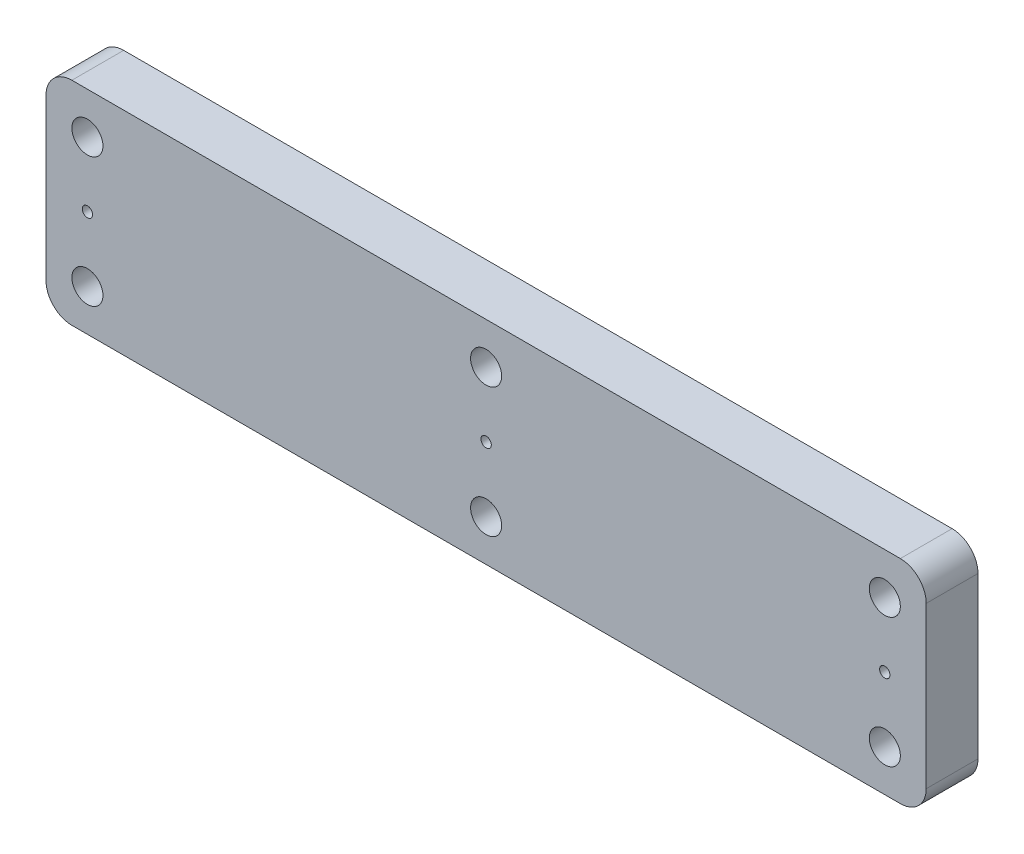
ISO-10303-21;
HEADER;
FILE_DESCRIPTION(('STEP AP214'),'2;1');
FILE_NAME('part.step','',(''),(''),'','','');
FILE_SCHEMA(('AUTOMOTIVE_DESIGN { 1 0 10303 214 1 1 1 1 }'));
ENDSEC;
DATA;
#1=APPLICATION_CONTEXT('core data for automotive mechanical design processes');
#2=APPLICATION_PROTOCOL_DEFINITION('international standard','automotive_design',2000,#1);
#3=PRODUCT_CONTEXT('',#1,'mechanical');
#4=PRODUCT('Part','Part','',(#3));
#5=PRODUCT_RELATED_PRODUCT_CATEGORY('part','',(#4));
#6=PRODUCT_DEFINITION_FORMATION('','',#4);
#7=PRODUCT_DEFINITION_CONTEXT('part definition',#1,'design');
#8=PRODUCT_DEFINITION('design','',#6,#7);
#9=PRODUCT_DEFINITION_SHAPE('','',#8);
#10=(LENGTH_UNIT() NAMED_UNIT(*) SI_UNIT(.MILLI.,.METRE.));
#11=(NAMED_UNIT(*) PLANE_ANGLE_UNIT() SI_UNIT($,.RADIAN.));
#12=(NAMED_UNIT(*) SI_UNIT($,.STERADIAN.) SOLID_ANGLE_UNIT());
#13=UNCERTAINTY_MEASURE_WITH_UNIT(LENGTH_MEASURE(1.E-05),#10,'distance_accuracy_value','');
#14=(GEOMETRIC_REPRESENTATION_CONTEXT(3) GLOBAL_UNCERTAINTY_ASSIGNED_CONTEXT((#13)) GLOBAL_UNIT_ASSIGNED_CONTEXT((#10,
#11,#12)) REPRESENTATION_CONTEXT('',''));
#15=CARTESIAN_POINT('',(0.,0.,0.));
#16=DIRECTION('',(0.,0.,1.));
#17=DIRECTION('',(1.,0.,0.));
#18=AXIS2_PLACEMENT_3D('',#15,#16,#17);
#19=CARTESIAN_POINT('',(5.,36.,10.));
#20=DIRECTION('',(0.,0.,-1.));
#21=DIRECTION('',(-1.,0.,0.));
#22=AXIS2_PLACEMENT_3D('',#19,#20,#21);
#23=PLANE('',#22);
#24=CARTESIAN_POINT('',(162.,20.5,10.));
#25=DIRECTION('',(0.,0.,1.));
#26=DIRECTION('',(1.,0.,0.));
#27=AXIS2_PLACEMENT_3D('',#24,#25,#26);
#28=CIRCLE('',#27,0.999999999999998);
#29=CARTESIAN_POINT('',(163.,20.5,10.));
#30=VERTEX_POINT('',#29);
#31=EDGE_CURVE('E250',#30,#30,#28,.T.);
#32=ORIENTED_EDGE('',*,*,#31,.F.);
#33=EDGE_LOOP('',(#32));
#34=FACE_BOUND('',#33,.T.);
#35=CARTESIAN_POINT('',(85.,20.5,10.));
#36=DIRECTION('',(0.,0.,1.));
#37=DIRECTION('',(1.,0.,0.));
#38=AXIS2_PLACEMENT_3D('',#35,#36,#37);
#39=CIRCLE('',#38,0.999999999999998);
#40=CARTESIAN_POINT('',(86.,20.5,10.));
#41=VERTEX_POINT('',#40);
#42=EDGE_CURVE('E249',#41,#41,#39,.T.);
#43=ORIENTED_EDGE('',*,*,#42,.F.);
#44=EDGE_LOOP('',(#43));
#45=FACE_BOUND('',#44,.T.);
#46=CARTESIAN_POINT('',(8.,20.5,10.));
#47=DIRECTION('',(0.,0.,1.));
#48=DIRECTION('',(1.,0.,0.));
#49=AXIS2_PLACEMENT_3D('',#46,#47,#48);
#50=CIRCLE('',#49,1.);
#51=CARTESIAN_POINT('',(9.,20.5,10.));
#52=VERTEX_POINT('',#51);
#53=EDGE_CURVE('E260',#52,#52,#50,.T.);
#54=ORIENTED_EDGE('',*,*,#53,.F.);
#55=EDGE_LOOP('',(#54));
#56=FACE_BOUND('',#55,.T.);
#57=CARTESIAN_POINT('',(85.,8.,10.));
#58=DIRECTION('',(0.,0.,1.));
#59=DIRECTION('',(1.,0.,0.));
#60=AXIS2_PLACEMENT_3D('',#57,#58,#59);
#61=CIRCLE('',#60,3.00000000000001);
#62=CARTESIAN_POINT('',(88.,8.,10.));
#63=VERTEX_POINT('',#62);
#64=EDGE_CURVE('E275',#63,#63,#61,.T.);
#65=ORIENTED_EDGE('',*,*,#64,.F.);
#66=EDGE_LOOP('',(#65));
#67=FACE_BOUND('',#66,.T.);
#68=CARTESIAN_POINT('',(162.,8.,10.));
#69=DIRECTION('',(0.,0.,1.));
#70=DIRECTION('',(1.,0.,0.));
#71=AXIS2_PLACEMENT_3D('',#68,#69,#70);
#72=CIRCLE('',#71,2.99999999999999);
#73=CARTESIAN_POINT('',(165.,8.,10.));
#74=VERTEX_POINT('',#73);
#75=EDGE_CURVE('E287',#74,#74,#72,.T.);
#76=ORIENTED_EDGE('',*,*,#75,.F.);
#77=EDGE_LOOP('',(#76));
#78=FACE_BOUND('',#77,.T.);
#79=CARTESIAN_POINT('',(8.,33.,10.));
#80=DIRECTION('',(0.,0.,1.));
#81=DIRECTION('',(1.,0.,0.));
#82=AXIS2_PLACEMENT_3D('',#79,#80,#81);
#83=CIRCLE('',#82,3.);
#84=CARTESIAN_POINT('',(11.,33.,10.));
#85=VERTEX_POINT('',#84);
#86=EDGE_CURVE('E110',#85,#85,#83,.T.);
#87=ORIENTED_EDGE('',*,*,#86,.F.);
#88=EDGE_LOOP('',(#87));
#89=FACE_BOUND('',#88,.T.);
#90=CARTESIAN_POINT('',(5.,36.,10.));
#91=DIRECTION('',(0.,0.,1.));
#92=DIRECTION('',(-1.,0.,0.));
#93=AXIS2_PLACEMENT_3D('',#90,#91,#92);
#94=CIRCLE('',#93,5.);
#95=CARTESIAN_POINT('',(5.00000000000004,41.,10.));
#96=VERTEX_POINT('',#95);
#97=CARTESIAN_POINT('',(0.,36.,10.));
#98=VERTEX_POINT('',#97);
#99=EDGE_CURVE('E128',#96,#98,#94,.T.);
#100=ORIENTED_EDGE('',*,*,#99,.T.);
#101=DIRECTION('',(0.,-1.,0.));
#102=VECTOR('',#101,1.);
#103=CARTESIAN_POINT('',(0.,5.00000000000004,10.));
#104=LINE('',#103,#102);
#105=CARTESIAN_POINT('',(0.,5.00000000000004,10.));
#106=VERTEX_POINT('',#105);
#107=EDGE_CURVE('E105',#98,#106,#104,.T.);
#108=ORIENTED_EDGE('',*,*,#107,.T.);
#109=CARTESIAN_POINT('',(5.,5.,10.));
#110=DIRECTION('',(0.,0.,1.));
#111=DIRECTION('',(-1.,0.,0.));
#112=AXIS2_PLACEMENT_3D('',#109,#110,#111);
#113=CIRCLE('',#112,5.);
#114=CARTESIAN_POINT('',(5.00000000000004,0.,10.));
#115=VERTEX_POINT('',#114);
#116=EDGE_CURVE('E131',#106,#115,#113,.T.);
#117=ORIENTED_EDGE('',*,*,#116,.T.);
#118=DIRECTION('',(1.,0.,0.));
#119=VECTOR('',#118,1.);
#120=CARTESIAN_POINT('',(5.00000000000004,0.,10.));
#121=LINE('',#120,#119);
#122=CARTESIAN_POINT('',(165.,0.,10.));
#123=VERTEX_POINT('',#122);
#124=EDGE_CURVE('E133',#115,#123,#121,.T.);
#125=ORIENTED_EDGE('',*,*,#124,.T.);
#126=CARTESIAN_POINT('',(165.,5.,10.));
#127=DIRECTION('',(0.,0.,1.));
#128=DIRECTION('',(1.,0.,0.));
#129=AXIS2_PLACEMENT_3D('',#126,#127,#128);
#130=CIRCLE('',#129,5.);
#131=CARTESIAN_POINT('',(170.,5.00000000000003,10.));
#132=VERTEX_POINT('',#131);
#133=EDGE_CURVE('E135',#123,#132,#130,.T.);
#134=ORIENTED_EDGE('',*,*,#133,.T.);
#135=DIRECTION('',(0.,1.,0.));
#136=VECTOR('',#135,1.);
#137=CARTESIAN_POINT('',(170.,5.00000000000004,10.));
#138=LINE('',#137,#136);
#139=CARTESIAN_POINT('',(170.,36.,10.));
#140=VERTEX_POINT('',#139);
#141=EDGE_CURVE('E137',#132,#140,#138,.T.);
#142=ORIENTED_EDGE('',*,*,#141,.T.);
#143=CARTESIAN_POINT('',(165.,36.,10.));
#144=DIRECTION('',(0.,0.,1.));
#145=DIRECTION('',(-1.,0.,0.));
#146=AXIS2_PLACEMENT_3D('',#143,#144,#145);
#147=CIRCLE('',#146,5.);
#148=CARTESIAN_POINT('',(165.,41.,10.));
#149=VERTEX_POINT('',#148);
#150=EDGE_CURVE('E46',#140,#149,#147,.T.);
#151=ORIENTED_EDGE('',*,*,#150,.T.);
#152=DIRECTION('',(-1.,0.,0.));
#153=VECTOR('',#152,1.);
#154=CARTESIAN_POINT('',(5.00000000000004,41.,10.));
#155=LINE('',#154,#153);
#156=EDGE_CURVE('E41',#149,#96,#155,.T.);
#157=ORIENTED_EDGE('',*,*,#156,.T.);
#158=EDGE_LOOP('',(#100,#108,#117,#125,#134,#142,#151,#157));
#159=FACE_BOUND('',#158,.T.);
#160=CARTESIAN_POINT('',(162.,33.,10.));
#161=DIRECTION('',(0.,0.,1.));
#162=DIRECTION('',(1.,0.,0.));
#163=AXIS2_PLACEMENT_3D('',#160,#161,#162);
#164=CIRCLE('',#163,2.99999999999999);
#165=CARTESIAN_POINT('',(165.,33.,10.));
#166=VERTEX_POINT('',#165);
#167=EDGE_CURVE('E293',#166,#166,#164,.T.);
#168=ORIENTED_EDGE('',*,*,#167,.F.);
#169=EDGE_LOOP('',(#168));
#170=FACE_BOUND('',#169,.T.);
#171=CARTESIAN_POINT('',(85.,33.,10.));
#172=DIRECTION('',(0.,0.,1.));
#173=DIRECTION('',(1.,0.,0.));
#174=AXIS2_PLACEMENT_3D('',#171,#172,#173);
#175=CIRCLE('',#174,3.00000000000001);
#176=CARTESIAN_POINT('',(88.,33.,10.));
#177=VERTEX_POINT('',#176);
#178=EDGE_CURVE('E281',#177,#177,#175,.T.);
#179=ORIENTED_EDGE('',*,*,#178,.F.);
#180=EDGE_LOOP('',(#179));
#181=FACE_BOUND('',#180,.T.);
#182=CARTESIAN_POINT('',(8.00000000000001,8.,10.));
#183=DIRECTION('',(0.,0.,1.));
#184=DIRECTION('',(1.,0.,0.));
#185=AXIS2_PLACEMENT_3D('',#182,#183,#184);
#186=CIRCLE('',#185,3.);
#187=CARTESIAN_POINT('',(11.,8.,10.));
#188=VERTEX_POINT('',#187);
#189=EDGE_CURVE('E269',#188,#188,#186,.T.);
#190=ORIENTED_EDGE('',*,*,#189,.F.);
#191=EDGE_LOOP('',(#190));
#192=FACE_BOUND('',#191,.T.);
#193=ADVANCED_FACE('F26',(#34,#45,#56,#67,#78,#89,#159,#170,#181,#192),#23,.F.);
#194=CARTESIAN_POINT('',(5.,36.,0.));
#195=DIRECTION('',(0.,0.,-1.));
#196=DIRECTION('',(-1.,0.,0.));
#197=AXIS2_PLACEMENT_3D('',#194,#195,#196);
#198=PLANE('',#197);
#199=CARTESIAN_POINT('',(85.,8.,0.));
#200=DIRECTION('',(0.,0.,1.));
#201=DIRECTION('',(1.,0.,0.));
#202=AXIS2_PLACEMENT_3D('',#199,#200,#201);
#203=CIRCLE('',#202,3.00000000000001);
#204=CARTESIAN_POINT('',(88.,8.,0.));
#205=VERTEX_POINT('',#204);
#206=EDGE_CURVE('E272',#205,#205,#203,.T.);
#207=ORIENTED_EDGE('',*,*,#206,.T.);
#208=EDGE_LOOP('',(#207));
#209=FACE_BOUND('',#208,.T.);
#210=CARTESIAN_POINT('',(162.,8.,0.));
#211=DIRECTION('',(0.,0.,1.));
#212=DIRECTION('',(1.,0.,0.));
#213=AXIS2_PLACEMENT_3D('',#210,#211,#212);
#214=CIRCLE('',#213,2.99999999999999);
#215=CARTESIAN_POINT('',(165.,8.,0.));
#216=VERTEX_POINT('',#215);
#217=EDGE_CURVE('E284',#216,#216,#214,.T.);
#218=ORIENTED_EDGE('',*,*,#217,.T.);
#219=EDGE_LOOP('',(#218));
#220=FACE_BOUND('',#219,.T.);
#221=CARTESIAN_POINT('',(8.,33.,0.));
#222=DIRECTION('',(0.,0.,1.));
#223=DIRECTION('',(1.,0.,0.));
#224=AXIS2_PLACEMENT_3D('',#221,#222,#223);
#225=CIRCLE('',#224,3.);
#226=CARTESIAN_POINT('',(11.,33.,0.));
#227=VERTEX_POINT('',#226);
#228=EDGE_CURVE('E113',#227,#227,#225,.T.);
#229=ORIENTED_EDGE('',*,*,#228,.T.);
#230=EDGE_LOOP('',(#229));
#231=FACE_BOUND('',#230,.T.);
#232=CARTESIAN_POINT('',(5.,36.,0.));
#233=DIRECTION('',(0.,0.,1.));
#234=DIRECTION('',(-1.,0.,0.));
#235=AXIS2_PLACEMENT_3D('',#232,#233,#234);
#236=CIRCLE('',#235,5.);
#237=CARTESIAN_POINT('',(5.00000000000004,41.,0.));
#238=VERTEX_POINT('',#237);
#239=CARTESIAN_POINT('',(0.,36.,0.));
#240=VERTEX_POINT('',#239);
#241=EDGE_CURVE('E96',#238,#240,#236,.T.);
#242=ORIENTED_EDGE('',*,*,#241,.F.);
#243=DIRECTION('',(-1.,0.,0.));
#244=VECTOR('',#243,1.);
#245=CARTESIAN_POINT('',(5.00000000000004,41.,0.));
#246=LINE('',#245,#244);
#247=CARTESIAN_POINT('',(165.,41.,0.));
#248=VERTEX_POINT('',#247);
#249=EDGE_CURVE('E126',#248,#238,#246,.T.);
#250=ORIENTED_EDGE('',*,*,#249,.F.);
#251=CARTESIAN_POINT('',(165.,36.,0.));
#252=DIRECTION('',(0.,0.,1.));
#253=DIRECTION('',(-1.,0.,0.));
#254=AXIS2_PLACEMENT_3D('',#251,#252,#253);
#255=CIRCLE('',#254,5.);
#256=CARTESIAN_POINT('',(170.,36.,0.));
#257=VERTEX_POINT('',#256);
#258=EDGE_CURVE('E124',#257,#248,#255,.T.);
#259=ORIENTED_EDGE('',*,*,#258,.F.);
#260=DIRECTION('',(0.,1.,0.));
#261=VECTOR('',#260,1.);
#262=CARTESIAN_POINT('',(170.,5.00000000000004,0.));
#263=LINE('',#262,#261);
#264=CARTESIAN_POINT('',(170.,5.00000000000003,0.));
#265=VERTEX_POINT('',#264);
#266=EDGE_CURVE('E122',#265,#257,#263,.T.);
#267=ORIENTED_EDGE('',*,*,#266,.F.);
#268=CARTESIAN_POINT('',(165.,5.,0.));
#269=DIRECTION('',(0.,0.,1.));
#270=DIRECTION('',(1.,0.,0.));
#271=AXIS2_PLACEMENT_3D('',#268,#269,#270);
#272=CIRCLE('',#271,5.);
#273=CARTESIAN_POINT('',(165.,0.,0.));
#274=VERTEX_POINT('',#273);
#275=EDGE_CURVE('E120',#274,#265,#272,.T.);
#276=ORIENTED_EDGE('',*,*,#275,.F.);
#277=DIRECTION('',(1.,0.,0.));
#278=VECTOR('',#277,1.);
#279=CARTESIAN_POINT('',(5.00000000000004,0.,0.));
#280=LINE('',#279,#278);
#281=CARTESIAN_POINT('',(5.00000000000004,0.,0.));
#282=VERTEX_POINT('',#281);
#283=EDGE_CURVE('E118',#282,#274,#280,.T.);
#284=ORIENTED_EDGE('',*,*,#283,.F.);
#285=CARTESIAN_POINT('',(5.,5.,0.));
#286=DIRECTION('',(0.,0.,1.));
#287=DIRECTION('',(-1.,0.,0.));
#288=AXIS2_PLACEMENT_3D('',#285,#286,#287);
#289=CIRCLE('',#288,5.);
#290=CARTESIAN_POINT('',(0.,5.00000000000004,0.));
#291=VERTEX_POINT('',#290);
#292=EDGE_CURVE('E98',#291,#282,#289,.T.);
#293=ORIENTED_EDGE('',*,*,#292,.F.);
#294=DIRECTION('',(0.,-1.,0.));
#295=VECTOR('',#294,1.);
#296=CARTESIAN_POINT('',(0.,5.00000000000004,0.));
#297=LINE('',#296,#295);
#298=EDGE_CURVE('E91',#240,#291,#297,.T.);
#299=ORIENTED_EDGE('',*,*,#298,.F.);
#300=EDGE_LOOP('',(#242,#250,#259,#267,#276,#284,#293,#299));
#301=FACE_BOUND('',#300,.T.);
#302=CARTESIAN_POINT('',(162.,33.,0.));
#303=DIRECTION('',(0.,0.,1.));
#304=DIRECTION('',(1.,0.,0.));
#305=AXIS2_PLACEMENT_3D('',#302,#303,#304);
#306=CIRCLE('',#305,2.99999999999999);
#307=CARTESIAN_POINT('',(165.,33.,0.));
#308=VERTEX_POINT('',#307);
#309=EDGE_CURVE('E290',#308,#308,#306,.T.);
#310=ORIENTED_EDGE('',*,*,#309,.T.);
#311=EDGE_LOOP('',(#310));
#312=FACE_BOUND('',#311,.T.);
#313=CARTESIAN_POINT('',(85.,33.,0.));
#314=DIRECTION('',(0.,0.,1.));
#315=DIRECTION('',(1.,0.,0.));
#316=AXIS2_PLACEMENT_3D('',#313,#314,#315);
#317=CIRCLE('',#316,3.00000000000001);
#318=CARTESIAN_POINT('',(88.,33.,0.));
#319=VERTEX_POINT('',#318);
#320=EDGE_CURVE('E278',#319,#319,#317,.T.);
#321=ORIENTED_EDGE('',*,*,#320,.T.);
#322=EDGE_LOOP('',(#321));
#323=FACE_BOUND('',#322,.T.);
#324=CARTESIAN_POINT('',(8.00000000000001,8.,0.));
#325=DIRECTION('',(0.,0.,1.));
#326=DIRECTION('',(1.,0.,0.));
#327=AXIS2_PLACEMENT_3D('',#324,#325,#326);
#328=CIRCLE('',#327,3.);
#329=CARTESIAN_POINT('',(11.,8.,0.));
#330=VERTEX_POINT('',#329);
#331=EDGE_CURVE('E266',#330,#330,#328,.T.);
#332=ORIENTED_EDGE('',*,*,#331,.T.);
#333=EDGE_LOOP('',(#332));
#334=FACE_BOUND('',#333,.T.);
#335=ADVANCED_FACE('F92',(#209,#220,#231,#301,#312,#323,#334),#198,.T.);
#336=CARTESIAN_POINT('',(5.,36.,10.));
#337=DIRECTION('',(0.,0.,-1.));
#338=DIRECTION('',(-1.,0.,0.));
#339=AXIS2_PLACEMENT_3D('',#336,#337,#338);
#340=CYLINDRICAL_SURFACE('',#339,5.);
#341=ORIENTED_EDGE('',*,*,#241,.T.);
#342=DIRECTION('',(0.,0.,-1.));
#343=VECTOR('',#342,1.);
#344=CARTESIAN_POINT('',(0.,36.,10.));
#345=LINE('',#344,#343);
#346=EDGE_CURVE('E11',#98,#240,#345,.T.);
#347=ORIENTED_EDGE('',*,*,#346,.F.);
#348=ORIENTED_EDGE('',*,*,#99,.F.);
#349=DIRECTION('',(0.,0.,-1.));
#350=VECTOR('',#349,1.);
#351=CARTESIAN_POINT('',(5.00000000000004,41.,10.));
#352=LINE('',#351,#350);
#353=EDGE_CURVE('E109',#96,#238,#352,.T.);
#354=ORIENTED_EDGE('',*,*,#353,.T.);
#355=EDGE_LOOP('',(#341,#347,#348,#354));
#356=FACE_BOUND('',#355,.T.);
#357=ADVANCED_FACE('F28',(#356),#340,.T.);
#358=CARTESIAN_POINT('',(0.,5.00000000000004,10.));
#359=DIRECTION('',(1.,0.,0.));
#360=DIRECTION('',(0.,0.,-1.));
#361=AXIS2_PLACEMENT_3D('',#358,#359,#360);
#362=PLANE('',#361);
#363=ORIENTED_EDGE('',*,*,#298,.T.);
#364=DIRECTION('',(0.,0.,-1.));
#365=VECTOR('',#364,1.);
#366=CARTESIAN_POINT('',(0.,5.00000000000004,10.));
#367=LINE('',#366,#365);
#368=EDGE_CURVE('E34',#106,#291,#367,.T.);
#369=ORIENTED_EDGE('',*,*,#368,.F.);
#370=ORIENTED_EDGE('',*,*,#107,.F.);
#371=ORIENTED_EDGE('',*,*,#346,.T.);
#372=EDGE_LOOP('',(#363,#369,#370,#371));
#373=FACE_BOUND('',#372,.T.);
#374=ADVANCED_FACE('F104',(#373),#362,.F.);
#375=CARTESIAN_POINT('',(5.,5.,10.));
#376=DIRECTION('',(0.,0.,-1.));
#377=DIRECTION('',(-1.,0.,0.));
#378=AXIS2_PLACEMENT_3D('',#375,#376,#377);
#379=CYLINDRICAL_SURFACE('',#378,5.);
#380=ORIENTED_EDGE('',*,*,#292,.T.);
#381=DIRECTION('',(0.,0.,-1.));
#382=VECTOR('',#381,1.);
#383=CARTESIAN_POINT('',(5.00000000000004,0.,10.));
#384=LINE('',#383,#382);
#385=EDGE_CURVE('E154',#115,#282,#384,.T.);
#386=ORIENTED_EDGE('',*,*,#385,.F.);
#387=ORIENTED_EDGE('',*,*,#116,.F.);
#388=ORIENTED_EDGE('',*,*,#368,.T.);
#389=EDGE_LOOP('',(#380,#386,#387,#388));
#390=FACE_BOUND('',#389,.T.);
#391=ADVANCED_FACE('F158',(#390),#379,.T.);
#392=CARTESIAN_POINT('',(5.00000000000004,0.,10.));
#393=DIRECTION('',(0.,1.,0.));
#394=DIRECTION('',(0.,0.,1.));
#395=AXIS2_PLACEMENT_3D('',#392,#393,#394);
#396=PLANE('',#395);
#397=ORIENTED_EDGE('',*,*,#283,.T.);
#398=DIRECTION('',(0.,0.,-1.));
#399=VECTOR('',#398,1.);
#400=CARTESIAN_POINT('',(165.,0.,10.));
#401=LINE('',#400,#399);
#402=EDGE_CURVE('E151',#123,#274,#401,.T.);
#403=ORIENTED_EDGE('',*,*,#402,.F.);
#404=ORIENTED_EDGE('',*,*,#124,.F.);
#405=ORIENTED_EDGE('',*,*,#385,.T.);
#406=EDGE_LOOP('',(#397,#403,#404,#405));
#407=FACE_BOUND('',#406,.T.);
#408=ADVANCED_FACE('F166',(#407),#396,.F.);
#409=CARTESIAN_POINT('',(165.,5.,10.));
#410=DIRECTION('',(0.,0.,-1.));
#411=DIRECTION('',(-1.,0.,0.));
#412=AXIS2_PLACEMENT_3D('',#409,#410,#411);
#413=CYLINDRICAL_SURFACE('',#412,5.);
#414=ORIENTED_EDGE('',*,*,#275,.T.);
#415=DIRECTION('',(0.,0.,-1.));
#416=VECTOR('',#415,1.);
#417=CARTESIAN_POINT('',(170.,5.00000000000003,10.));
#418=LINE('',#417,#416);
#419=EDGE_CURVE('E148',#132,#265,#418,.T.);
#420=ORIENTED_EDGE('',*,*,#419,.F.);
#421=ORIENTED_EDGE('',*,*,#133,.F.);
#422=ORIENTED_EDGE('',*,*,#402,.T.);
#423=EDGE_LOOP('',(#414,#420,#421,#422));
#424=FACE_BOUND('',#423,.T.);
#425=ADVANCED_FACE('F169',(#424),#413,.T.);
#426=CARTESIAN_POINT('',(170.,5.00000000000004,10.));
#427=DIRECTION('',(-1.,0.,0.));
#428=DIRECTION('',(0.,0.,1.));
#429=AXIS2_PLACEMENT_3D('',#426,#427,#428);
#430=PLANE('',#429);
#431=ORIENTED_EDGE('',*,*,#266,.T.);
#432=DIRECTION('',(0.,0.,-1.));
#433=VECTOR('',#432,1.);
#434=CARTESIAN_POINT('',(170.,36.,10.));
#435=LINE('',#434,#433);
#436=EDGE_CURVE('E145',#140,#257,#435,.T.);
#437=ORIENTED_EDGE('',*,*,#436,.F.);
#438=ORIENTED_EDGE('',*,*,#141,.F.);
#439=ORIENTED_EDGE('',*,*,#419,.T.);
#440=EDGE_LOOP('',(#431,#437,#438,#439));
#441=FACE_BOUND('',#440,.T.);
#442=ADVANCED_FACE('F174',(#441),#430,.F.);
#443=CARTESIAN_POINT('',(165.,36.,10.));
#444=DIRECTION('',(0.,0.,-1.));
#445=DIRECTION('',(-1.,0.,0.));
#446=AXIS2_PLACEMENT_3D('',#443,#444,#445);
#447=CYLINDRICAL_SURFACE('',#446,5.);
#448=ORIENTED_EDGE('',*,*,#258,.T.);
#449=DIRECTION('',(0.,0.,-1.));
#450=VECTOR('',#449,1.);
#451=CARTESIAN_POINT('',(165.,41.,10.));
#452=LINE('',#451,#450);
#453=EDGE_CURVE('E142',#149,#248,#452,.T.);
#454=ORIENTED_EDGE('',*,*,#453,.F.);
#455=ORIENTED_EDGE('',*,*,#150,.F.);
#456=ORIENTED_EDGE('',*,*,#436,.T.);
#457=EDGE_LOOP('',(#448,#454,#455,#456));
#458=FACE_BOUND('',#457,.T.);
#459=ADVANCED_FACE('F177',(#458),#447,.T.);
#460=CARTESIAN_POINT('',(5.00000000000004,41.,10.));
#461=DIRECTION('',(0.,-1.,0.));
#462=DIRECTION('',(0.,0.,-1.));
#463=AXIS2_PLACEMENT_3D('',#460,#461,#462);
#464=PLANE('',#463);
#465=ORIENTED_EDGE('',*,*,#249,.T.);
#466=ORIENTED_EDGE('',*,*,#353,.F.);
#467=ORIENTED_EDGE('',*,*,#156,.F.);
#468=ORIENTED_EDGE('',*,*,#453,.T.);
#469=EDGE_LOOP('',(#465,#466,#467,#468));
#470=FACE_BOUND('',#469,.T.);
#471=ADVANCED_FACE('F179',(#470),#464,.F.);
#472=CARTESIAN_POINT('',(8.,33.,10.));
#473=DIRECTION('',(0.,0.,-1.));
#474=DIRECTION('',(-1.,0.,0.));
#475=AXIS2_PLACEMENT_3D('',#472,#473,#474);
#476=CYLINDRICAL_SURFACE('',#475,3.);
#477=ORIENTED_EDGE('',*,*,#86,.T.);
#478=EDGE_LOOP('',(#477));
#479=FACE_BOUND('',#478,.T.);
#480=ORIENTED_EDGE('',*,*,#228,.F.);
#481=EDGE_LOOP('',(#480));
#482=FACE_BOUND('',#481,.T.);
#483=ADVANCED_FACE('F181',(#479,#482),#476,.F.);
#484=CARTESIAN_POINT('',(162.,33.,10.));
#485=DIRECTION('',(0.,0.,-1.));
#486=DIRECTION('',(-1.,0.,0.));
#487=AXIS2_PLACEMENT_3D('',#484,#485,#486);
#488=CYLINDRICAL_SURFACE('',#487,2.99999999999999);
#489=ORIENTED_EDGE('',*,*,#167,.T.);
#490=EDGE_LOOP('',(#489));
#491=FACE_BOUND('',#490,.T.);
#492=ORIENTED_EDGE('',*,*,#309,.F.);
#493=EDGE_LOOP('',(#492));
#494=FACE_BOUND('',#493,.T.);
#495=ADVANCED_FACE('F187',(#491,#494),#488,.F.);
#496=CARTESIAN_POINT('',(162.,8.,10.));
#497=DIRECTION('',(0.,0.,-1.));
#498=DIRECTION('',(-1.,0.,0.));
#499=AXIS2_PLACEMENT_3D('',#496,#497,#498);
#500=CYLINDRICAL_SURFACE('',#499,2.99999999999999);
#501=ORIENTED_EDGE('',*,*,#75,.T.);
#502=EDGE_LOOP('',(#501));
#503=FACE_BOUND('',#502,.T.);
#504=ORIENTED_EDGE('',*,*,#217,.F.);
#505=EDGE_LOOP('',(#504));
#506=FACE_BOUND('',#505,.T.);
#507=ADVANCED_FACE('F206',(#503,#506),#500,.F.);
#508=CARTESIAN_POINT('',(85.,33.,10.));
#509=DIRECTION('',(0.,0.,-1.));
#510=DIRECTION('',(-1.,0.,0.));
#511=AXIS2_PLACEMENT_3D('',#508,#509,#510);
#512=CYLINDRICAL_SURFACE('',#511,3.00000000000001);
#513=ORIENTED_EDGE('',*,*,#178,.T.);
#514=EDGE_LOOP('',(#513));
#515=FACE_BOUND('',#514,.T.);
#516=ORIENTED_EDGE('',*,*,#320,.F.);
#517=EDGE_LOOP('',(#516));
#518=FACE_BOUND('',#517,.T.);
#519=ADVANCED_FACE('F210',(#515,#518),#512,.F.);
#520=CARTESIAN_POINT('',(85.,8.,10.));
#521=DIRECTION('',(0.,0.,-1.));
#522=DIRECTION('',(-1.,0.,0.));
#523=AXIS2_PLACEMENT_3D('',#520,#521,#522);
#524=CYLINDRICAL_SURFACE('',#523,3.00000000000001);
#525=ORIENTED_EDGE('',*,*,#64,.T.);
#526=EDGE_LOOP('',(#525));
#527=FACE_BOUND('',#526,.T.);
#528=ORIENTED_EDGE('',*,*,#206,.F.);
#529=EDGE_LOOP('',(#528));
#530=FACE_BOUND('',#529,.T.);
#531=ADVANCED_FACE('F214',(#527,#530),#524,.F.);
#532=CARTESIAN_POINT('',(8.00000000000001,8.,10.));
#533=DIRECTION('',(0.,0.,-1.));
#534=DIRECTION('',(-1.,0.,0.));
#535=AXIS2_PLACEMENT_3D('',#532,#533,#534);
#536=CYLINDRICAL_SURFACE('',#535,3.);
#537=ORIENTED_EDGE('',*,*,#189,.T.);
#538=EDGE_LOOP('',(#537));
#539=FACE_BOUND('',#538,.T.);
#540=ORIENTED_EDGE('',*,*,#331,.F.);
#541=EDGE_LOOP('',(#540));
#542=FACE_BOUND('',#541,.T.);
#543=ADVANCED_FACE('F218',(#539,#542),#536,.F.);
#544=CARTESIAN_POINT('',(8.,20.5,8.));
#545=DIRECTION('',(0.,0.,1.));
#546=DIRECTION('',(1.,0.,0.));
#547=AXIS2_PLACEMENT_3D('',#544,#545,#546);
#548=CYLINDRICAL_SURFACE('',#547,1.);
#549=CARTESIAN_POINT('',(8.,20.5,8.));
#550=DIRECTION('',(0.,0.,1.));
#551=DIRECTION('',(1.,0.,0.));
#552=AXIS2_PLACEMENT_3D('',#549,#550,#551);
#553=CIRCLE('',#552,1.);
#554=CARTESIAN_POINT('',(9.,20.5,8.));
#555=VERTEX_POINT('',#554);
#556=EDGE_CURVE('E263',#555,#555,#553,.T.);
#557=ORIENTED_EDGE('',*,*,#556,.F.);
#558=EDGE_LOOP('',(#557));
#559=FACE_BOUND('',#558,.T.);
#560=ORIENTED_EDGE('',*,*,#53,.T.);
#561=EDGE_LOOP('',(#560));
#562=FACE_BOUND('',#561,.T.);
#563=ADVANCED_FACE('F221',(#559,#562),#548,.F.);
#564=CARTESIAN_POINT('',(8.,20.5,8.));
#565=DIRECTION('',(0.,0.,1.));
#566=DIRECTION('',(1.,0.,0.));
#567=AXIS2_PLACEMENT_3D('',#564,#565,#566);
#568=PLANE('',#567);
#569=ORIENTED_EDGE('',*,*,#556,.T.);
#570=EDGE_LOOP('',(#569));
#571=FACE_BOUND('',#570,.T.);
#572=ADVANCED_FACE('F224',(#571),#568,.T.);
#573=CARTESIAN_POINT('',(85.,20.5,8.));
#574=DIRECTION('',(0.,0.,1.));
#575=DIRECTION('',(1.,0.,0.));
#576=AXIS2_PLACEMENT_3D('',#573,#574,#575);
#577=CYLINDRICAL_SURFACE('',#576,0.999999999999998);
#578=CARTESIAN_POINT('',(85.,20.5,8.));
#579=DIRECTION('',(0.,0.,1.));
#580=DIRECTION('',(1.,0.,0.));
#581=AXIS2_PLACEMENT_3D('',#578,#579,#580);
#582=CIRCLE('',#581,0.999999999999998);
#583=CARTESIAN_POINT('',(86.,20.5,8.));
#584=VERTEX_POINT('',#583);
#585=EDGE_CURVE('E253',#584,#584,#582,.T.);
#586=ORIENTED_EDGE('',*,*,#585,.F.);
#587=EDGE_LOOP('',(#586));
#588=FACE_BOUND('',#587,.T.);
#589=ORIENTED_EDGE('',*,*,#42,.T.);
#590=EDGE_LOOP('',(#589));
#591=FACE_BOUND('',#590,.T.);
#592=ADVANCED_FACE('F228',(#588,#591),#577,.F.);
#593=CARTESIAN_POINT('',(85.,20.5,8.));
#594=DIRECTION('',(0.,0.,1.));
#595=DIRECTION('',(1.,0.,0.));
#596=AXIS2_PLACEMENT_3D('',#593,#594,#595);
#597=PLANE('',#596);
#598=ORIENTED_EDGE('',*,*,#585,.T.);
#599=EDGE_LOOP('',(#598));
#600=FACE_BOUND('',#599,.T.);
#601=ADVANCED_FACE('F232',(#600),#597,.T.);
#602=CARTESIAN_POINT('',(162.,20.5,8.));
#603=DIRECTION('',(0.,0.,1.));
#604=DIRECTION('',(1.,0.,0.));
#605=AXIS2_PLACEMENT_3D('',#602,#603,#604);
#606=CYLINDRICAL_SURFACE('',#605,0.999999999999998);
#607=CARTESIAN_POINT('',(162.,20.5,8.));
#608=DIRECTION('',(0.,0.,1.));
#609=DIRECTION('',(1.,0.,0.));
#610=AXIS2_PLACEMENT_3D('',#607,#608,#609);
#611=CIRCLE('',#610,0.999999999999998);
#612=CARTESIAN_POINT('',(163.,20.5,8.));
#613=VERTEX_POINT('',#612);
#614=EDGE_CURVE('E248',#613,#613,#611,.T.);
#615=ORIENTED_EDGE('',*,*,#614,.F.);
#616=EDGE_LOOP('',(#615));
#617=FACE_BOUND('',#616,.T.);
#618=ORIENTED_EDGE('',*,*,#31,.T.);
#619=EDGE_LOOP('',(#618));
#620=FACE_BOUND('',#619,.T.);
#621=ADVANCED_FACE('F236',(#617,#620),#606,.F.);
#622=CARTESIAN_POINT('',(162.,20.5,8.));
#623=DIRECTION('',(0.,0.,1.));
#624=DIRECTION('',(1.,0.,0.));
#625=AXIS2_PLACEMENT_3D('',#622,#623,#624);
#626=PLANE('',#625);
#627=ORIENTED_EDGE('',*,*,#614,.T.);
#628=EDGE_LOOP('',(#627));
#629=FACE_BOUND('',#628,.T.);
#630=ADVANCED_FACE('F240',(#629),#626,.T.);
#631=CLOSED_SHELL('',(#193,#335,#357,#374,#391,#408,#425,#442,#459,#471,#483,#495,#507,#519,
#531,#543,#563,#572,#592,#601,#621,#630));
#632=MANIFOLD_SOLID_BREP('B2',#631);
#633=ADVANCED_BREP_SHAPE_REPRESENTATION('',(#18,#632),#14);
#634=SHAPE_DEFINITION_REPRESENTATION(#9,#633);
ENDSEC;
END-ISO-10303-21;
